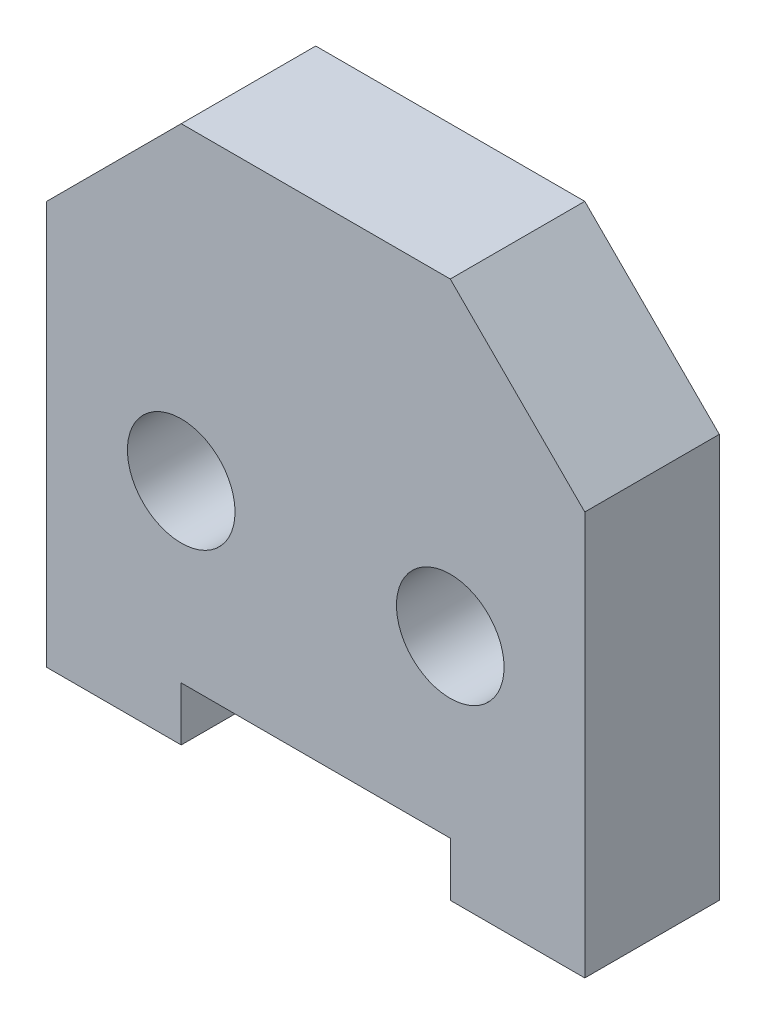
ISO-10303-21;
HEADER;
FILE_DESCRIPTION(('STEP AP214'),'2;1');
FILE_NAME('part.step','',(''),(''),'','','');
FILE_SCHEMA(('AUTOMOTIVE_DESIGN { 1 0 10303 214 1 1 1 1 }'));
ENDSEC;
DATA;
#1=APPLICATION_CONTEXT('core data for automotive mechanical design processes');
#2=APPLICATION_PROTOCOL_DEFINITION('international standard','automotive_design',2000,#1);
#3=PRODUCT_CONTEXT('',#1,'mechanical');
#4=PRODUCT('Part','Part','',(#3));
#5=PRODUCT_RELATED_PRODUCT_CATEGORY('part','',(#4));
#6=PRODUCT_DEFINITION_FORMATION('','',#4);
#7=PRODUCT_DEFINITION_CONTEXT('part definition',#1,'design');
#8=PRODUCT_DEFINITION('design','',#6,#7);
#9=PRODUCT_DEFINITION_SHAPE('','',#8);
#10=(LENGTH_UNIT() NAMED_UNIT(*) SI_UNIT(.MILLI.,.METRE.));
#11=(NAMED_UNIT(*) PLANE_ANGLE_UNIT() SI_UNIT($,.RADIAN.));
#12=(NAMED_UNIT(*) SI_UNIT($,.STERADIAN.) SOLID_ANGLE_UNIT());
#13=UNCERTAINTY_MEASURE_WITH_UNIT(LENGTH_MEASURE(1.E-05),#10,'distance_accuracy_value','');
#14=(GEOMETRIC_REPRESENTATION_CONTEXT(3) GLOBAL_UNCERTAINTY_ASSIGNED_CONTEXT((#13)) GLOBAL_UNIT_ASSIGNED_CONTEXT((#10,
#11,#12)) REPRESENTATION_CONTEXT('',''));
#15=CARTESIAN_POINT('',(0.,0.,0.));
#16=DIRECTION('',(0.,0.,1.));
#17=DIRECTION('',(1.,0.,0.));
#18=AXIS2_PLACEMENT_3D('',#15,#16,#17);
#19=CARTESIAN_POINT('',(0.,0.,10.));
#20=DIRECTION('',(0.,1.,0.));
#21=DIRECTION('',(0.,0.,1.));
#22=AXIS2_PLACEMENT_3D('',#19,#20,#21);
#23=PLANE('',#22);
#24=DIRECTION('',(1.,0.,0.));
#25=VECTOR('',#24,1.);
#26=CARTESIAN_POINT('',(0.,0.,0.));
#27=LINE('',#26,#25);
#28=CARTESIAN_POINT('',(-40.,0.,0.));
#29=VERTEX_POINT('',#28);
#30=CARTESIAN_POINT('',(-30.,0.,0.));
#31=VERTEX_POINT('',#30);
#32=EDGE_CURVE('E129',#29,#31,#27,.T.);
#33=ORIENTED_EDGE('',*,*,#32,.T.);
#34=DIRECTION('',(0.,0.,1.));
#35=VECTOR('',#34,1.);
#36=CARTESIAN_POINT('',(-30.,0.,0.));
#37=LINE('',#36,#35);
#38=CARTESIAN_POINT('',(-30.,0.,10.));
#39=VERTEX_POINT('',#38);
#40=EDGE_CURVE('E112',#31,#39,#37,.T.);
#41=ORIENTED_EDGE('',*,*,#40,.T.);
#42=DIRECTION('',(1.,0.,0.));
#43=VECTOR('',#42,1.);
#44=CARTESIAN_POINT('',(0.,0.,10.));
#45=LINE('',#44,#43);
#46=CARTESIAN_POINT('',(-40.,0.,10.));
#47=VERTEX_POINT('',#46);
#48=EDGE_CURVE('E149',#47,#39,#45,.T.);
#49=ORIENTED_EDGE('',*,*,#48,.F.);
#50=DIRECTION('',(0.,0.,-1.));
#51=VECTOR('',#50,1.);
#52=CARTESIAN_POINT('',(-40.,0.,10.));
#53=LINE('',#52,#51);
#54=EDGE_CURVE('E136',#47,#29,#53,.T.);
#55=ORIENTED_EDGE('',*,*,#54,.T.);
#56=EDGE_LOOP('',(#33,#41,#49,#55));
#57=FACE_BOUND('',#56,.T.);
#58=ADVANCED_FACE('F35',(#57),#23,.F.);
#59=CARTESIAN_POINT('',(0.,40.,10.));
#60=DIRECTION('',(-1.,0.,0.));
#61=DIRECTION('',(0.,0.,1.));
#62=AXIS2_PLACEMENT_3D('',#59,#60,#61);
#63=PLANE('',#62);
#64=DIRECTION('',(0.,1.,0.));
#65=VECTOR('',#64,1.);
#66=CARTESIAN_POINT('',(0.,40.,0.));
#67=LINE('',#66,#65);
#68=CARTESIAN_POINT('',(0.,0.,0.));
#69=VERTEX_POINT('',#68);
#70=CARTESIAN_POINT('',(0.,30.,0.));
#71=VERTEX_POINT('',#70);
#72=EDGE_CURVE('E185',#69,#71,#67,.T.);
#73=ORIENTED_EDGE('',*,*,#72,.T.);
#74=DIRECTION('',(0.,0.,1.));
#75=VECTOR('',#74,1.);
#76=CARTESIAN_POINT('',(0.,30.,10.));
#77=LINE('',#76,#75);
#78=CARTESIAN_POINT('',(0.,30.,10.));
#79=VERTEX_POINT('',#78);
#80=EDGE_CURVE('E11',#71,#79,#77,.T.);
#81=ORIENTED_EDGE('',*,*,#80,.T.);
#82=DIRECTION('',(0.,1.,0.));
#83=VECTOR('',#82,1.);
#84=CARTESIAN_POINT('',(0.,40.,10.));
#85=LINE('',#84,#83);
#86=CARTESIAN_POINT('',(0.,0.,10.));
#87=VERTEX_POINT('',#86);
#88=EDGE_CURVE('E137',#87,#79,#85,.T.);
#89=ORIENTED_EDGE('',*,*,#88,.F.);
#90=DIRECTION('',(0.,0.,-1.));
#91=VECTOR('',#90,1.);
#92=CARTESIAN_POINT('',(0.,0.,10.));
#93=LINE('',#92,#91);
#94=EDGE_CURVE('E146',#87,#69,#93,.T.);
#95=ORIENTED_EDGE('',*,*,#94,.T.);
#96=EDGE_LOOP('',(#73,#81,#89,#95));
#97=FACE_BOUND('',#96,.T.);
#98=ADVANCED_FACE('F237',(#97),#63,.F.);
#99=CARTESIAN_POINT('',(-40.,40.,10.));
#100=DIRECTION('',(0.,-1.,0.));
#101=DIRECTION('',(0.,0.,-1.));
#102=AXIS2_PLACEMENT_3D('',#99,#100,#101);
#103=PLANE('',#102);
#104=DIRECTION('',(-1.,0.,0.));
#105=VECTOR('',#104,1.);
#106=CARTESIAN_POINT('',(-40.,40.,0.));
#107=LINE('',#106,#105);
#108=CARTESIAN_POINT('',(-10.,40.,0.));
#109=VERTEX_POINT('',#108);
#110=CARTESIAN_POINT('',(-30.,40.,0.));
#111=VERTEX_POINT('',#110);
#112=EDGE_CURVE('E181',#109,#111,#107,.T.);
#113=ORIENTED_EDGE('',*,*,#112,.T.);
#114=DIRECTION('',(0.,0.,1.));
#115=VECTOR('',#114,1.);
#116=CARTESIAN_POINT('',(-30.,40.,10.));
#117=LINE('',#116,#115);
#118=CARTESIAN_POINT('',(-30.,40.,10.));
#119=VERTEX_POINT('',#118);
#120=EDGE_CURVE('E161',#111,#119,#117,.T.);
#121=ORIENTED_EDGE('',*,*,#120,.T.);
#122=DIRECTION('',(-1.,0.,0.));
#123=VECTOR('',#122,1.);
#124=CARTESIAN_POINT('',(-40.,40.,10.));
#125=LINE('',#124,#123);
#126=CARTESIAN_POINT('',(-10.,40.,10.));
#127=VERTEX_POINT('',#126);
#128=EDGE_CURVE('E140',#127,#119,#125,.T.);
#129=ORIENTED_EDGE('',*,*,#128,.F.);
#130=DIRECTION('',(0.,0.,-1.));
#131=VECTOR('',#130,1.);
#132=CARTESIAN_POINT('',(-10.,40.,10.));
#133=LINE('',#132,#131);
#134=EDGE_CURVE('E158',#127,#109,#133,.T.);
#135=ORIENTED_EDGE('',*,*,#134,.T.);
#136=EDGE_LOOP('',(#113,#121,#129,#135));
#137=FACE_BOUND('',#136,.T.);
#138=ADVANCED_FACE('F183',(#137),#103,.F.);
#139=CARTESIAN_POINT('',(-40.,0.,10.));
#140=DIRECTION('',(1.,0.,0.));
#141=DIRECTION('',(0.,0.,-1.));
#142=AXIS2_PLACEMENT_3D('',#139,#140,#141);
#143=PLANE('',#142);
#144=DIRECTION('',(0.,-1.,0.));
#145=VECTOR('',#144,1.);
#146=CARTESIAN_POINT('',(-40.,0.,10.));
#147=LINE('',#146,#145);
#148=CARTESIAN_POINT('',(-40.,30.,10.));
#149=VERTEX_POINT('',#148);
#150=EDGE_CURVE('E169',#149,#47,#147,.T.);
#151=ORIENTED_EDGE('',*,*,#150,.F.);
#152=DIRECTION('',(0.,0.,-1.));
#153=VECTOR('',#152,1.);
#154=CARTESIAN_POINT('',(-40.,30.,10.));
#155=LINE('',#154,#153);
#156=CARTESIAN_POINT('',(-40.,30.,0.));
#157=VERTEX_POINT('',#156);
#158=EDGE_CURVE('E151',#149,#157,#155,.T.);
#159=ORIENTED_EDGE('',*,*,#158,.T.);
#160=DIRECTION('',(0.,-1.,0.));
#161=VECTOR('',#160,1.);
#162=CARTESIAN_POINT('',(-40.,0.,0.));
#163=LINE('',#162,#161);
#164=EDGE_CURVE('E142',#157,#29,#163,.T.);
#165=ORIENTED_EDGE('',*,*,#164,.T.);
#166=ORIENTED_EDGE('',*,*,#54,.F.);
#167=EDGE_LOOP('',(#151,#159,#165,#166));
#168=FACE_BOUND('',#167,.T.);
#169=ADVANCED_FACE('F175',(#168),#143,.F.);
#170=CARTESIAN_POINT('',(-10.,0.,10.));
#171=VERTEX_POINT('',#170);
#172=EDGE_CURVE('E176',#171,#87,#45,.T.);
#173=ORIENTED_EDGE('',*,*,#172,.F.);
#174=DIRECTION('',(0.,0.,1.));
#175=VECTOR('',#174,1.);
#176=CARTESIAN_POINT('',(-10.,0.,0.));
#177=LINE('',#176,#175);
#178=CARTESIAN_POINT('',(-10.,0.,0.));
#179=VERTEX_POINT('',#178);
#180=EDGE_CURVE('E122',#179,#171,#177,.T.);
#181=ORIENTED_EDGE('',*,*,#180,.F.);
#182=EDGE_CURVE('E138',#179,#69,#27,.T.);
#183=ORIENTED_EDGE('',*,*,#182,.T.);
#184=ORIENTED_EDGE('',*,*,#94,.F.);
#185=EDGE_LOOP('',(#173,#181,#183,#184));
#186=FACE_BOUND('',#185,.T.);
#187=ADVANCED_FACE('F222',(#186),#23,.F.);
#188=CARTESIAN_POINT('',(0.,0.,10.));
#189=DIRECTION('',(0.,0.,-1.));
#190=DIRECTION('',(-1.,0.,0.));
#191=AXIS2_PLACEMENT_3D('',#188,#189,#190);
#192=PLANE('',#191);
#193=CARTESIAN_POINT('',(-10.,17.,10.));
#194=DIRECTION('',(0.,0.,1.));
#195=DIRECTION('',(1.,0.,0.));
#196=AXIS2_PLACEMENT_3D('',#193,#194,#195);
#197=CIRCLE('',#196,4.);
#198=CARTESIAN_POINT('',(-6.,17.,10.));
#199=VERTEX_POINT('',#198);
#200=EDGE_CURVE('E197',#199,#199,#197,.T.);
#201=ORIENTED_EDGE('',*,*,#200,.F.);
#202=EDGE_LOOP('',(#201));
#203=FACE_BOUND('',#202,.T.);
#204=CARTESIAN_POINT('',(-30.,17.,10.));
#205=DIRECTION('',(0.,0.,1.));
#206=DIRECTION('',(1.,0.,0.));
#207=AXIS2_PLACEMENT_3D('',#204,#205,#206);
#208=CIRCLE('',#207,4.);
#209=CARTESIAN_POINT('',(-26.,17.,10.));
#210=VERTEX_POINT('',#209);
#211=EDGE_CURVE('E191',#210,#210,#208,.T.);
#212=ORIENTED_EDGE('',*,*,#211,.F.);
#213=EDGE_LOOP('',(#212));
#214=FACE_BOUND('',#213,.T.);
#215=ORIENTED_EDGE('',*,*,#48,.T.);
#216=DIRECTION('',(0.,-1.,0.));
#217=VECTOR('',#216,1.);
#218=CARTESIAN_POINT('',(-30.,0.,10.));
#219=LINE('',#218,#217);
#220=CARTESIAN_POINT('',(-30.,4.,10.));
#221=VERTEX_POINT('',#220);
#222=EDGE_CURVE('E117',#221,#39,#219,.T.);
#223=ORIENTED_EDGE('',*,*,#222,.F.);
#224=DIRECTION('',(-1.,0.,0.));
#225=VECTOR('',#224,1.);
#226=CARTESIAN_POINT('',(-30.,4.,10.));
#227=LINE('',#226,#225);
#228=CARTESIAN_POINT('',(-10.,4.,10.));
#229=VERTEX_POINT('',#228);
#230=EDGE_CURVE('E132',#229,#221,#227,.T.);
#231=ORIENTED_EDGE('',*,*,#230,.F.);
#232=DIRECTION('',(0.,1.,0.));
#233=VECTOR('',#232,1.);
#234=CARTESIAN_POINT('',(-10.,0.,10.));
#235=LINE('',#234,#233);
#236=EDGE_CURVE('E209',#171,#229,#235,.T.);
#237=ORIENTED_EDGE('',*,*,#236,.F.);
#238=ORIENTED_EDGE('',*,*,#172,.T.);
#239=ORIENTED_EDGE('',*,*,#88,.T.);
#240=DIRECTION('',(0.707106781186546,-0.707106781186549,0.));
#241=VECTOR('',#240,1.);
#242=CARTESIAN_POINT('',(-10.,40.,10.));
#243=LINE('',#242,#241);
#244=EDGE_CURVE('E163',#79,#127,#243,.F.);
#245=ORIENTED_EDGE('',*,*,#244,.T.);
#246=ORIENTED_EDGE('',*,*,#128,.T.);
#247=DIRECTION('',(0.707106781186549,0.707106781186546,0.));
#248=VECTOR('',#247,1.);
#249=CARTESIAN_POINT('',(-40.,30.,10.));
#250=LINE('',#249,#248);
#251=EDGE_CURVE('E43',#119,#149,#250,.F.);
#252=ORIENTED_EDGE('',*,*,#251,.T.);
#253=ORIENTED_EDGE('',*,*,#150,.T.);
#254=EDGE_LOOP('',(#215,#223,#231,#237,#238,#239,#245,#246,#252,#253));
#255=FACE_BOUND('',#254,.T.);
#256=ADVANCED_FACE('F168',(#203,#214,#255),#192,.F.);
#257=CARTESIAN_POINT('',(0.,0.,0.));
#258=DIRECTION('',(0.,0.,-1.));
#259=DIRECTION('',(-1.,0.,0.));
#260=AXIS2_PLACEMENT_3D('',#257,#258,#259);
#261=PLANE('',#260);
#262=DIRECTION('',(0.,-1.,0.));
#263=VECTOR('',#262,1.);
#264=CARTESIAN_POINT('',(-30.,0.,0.));
#265=LINE('',#264,#263);
#266=CARTESIAN_POINT('',(-30.,4.,0.));
#267=VERTEX_POINT('',#266);
#268=EDGE_CURVE('E115',#267,#31,#265,.T.);
#269=ORIENTED_EDGE('',*,*,#268,.T.);
#270=ORIENTED_EDGE('',*,*,#32,.F.);
#271=ORIENTED_EDGE('',*,*,#164,.F.);
#272=DIRECTION('',(-0.707106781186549,-0.707106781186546,0.));
#273=VECTOR('',#272,1.);
#274=CARTESIAN_POINT('',(-34.9999999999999,35.,0.));
#275=LINE('',#274,#273);
#276=EDGE_CURVE('E156',#157,#111,#275,.F.);
#277=ORIENTED_EDGE('',*,*,#276,.T.);
#278=ORIENTED_EDGE('',*,*,#112,.F.);
#279=DIRECTION('',(-0.707106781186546,0.707106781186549,0.));
#280=VECTOR('',#279,1.);
#281=CARTESIAN_POINT('',(15.,14.9999999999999,0.));
#282=LINE('',#281,#280);
#283=EDGE_CURVE('E154',#109,#71,#282,.F.);
#284=ORIENTED_EDGE('',*,*,#283,.T.);
#285=ORIENTED_EDGE('',*,*,#72,.F.);
#286=ORIENTED_EDGE('',*,*,#182,.F.);
#287=DIRECTION('',(0.,1.,0.));
#288=VECTOR('',#287,1.);
#289=CARTESIAN_POINT('',(-10.,0.,0.));
#290=LINE('',#289,#288);
#291=CARTESIAN_POINT('',(-10.,4.,0.));
#292=VERTEX_POINT('',#291);
#293=EDGE_CURVE('E131',#179,#292,#290,.T.);
#294=ORIENTED_EDGE('',*,*,#293,.T.);
#295=DIRECTION('',(-1.,0.,0.));
#296=VECTOR('',#295,1.);
#297=CARTESIAN_POINT('',(-30.,4.,0.));
#298=LINE('',#297,#296);
#299=EDGE_CURVE('E50',#292,#267,#298,.T.);
#300=ORIENTED_EDGE('',*,*,#299,.T.);
#301=EDGE_LOOP('',(#269,#270,#271,#277,#278,#284,#285,#286,#294,#300));
#302=FACE_BOUND('',#301,.T.);
#303=CARTESIAN_POINT('',(-10.,17.,0.));
#304=DIRECTION('',(0.,0.,1.));
#305=DIRECTION('',(1.,0.,0.));
#306=AXIS2_PLACEMENT_3D('',#303,#304,#305);
#307=CIRCLE('',#306,4.);
#308=CARTESIAN_POINT('',(-6.,17.,0.));
#309=VERTEX_POINT('',#308);
#310=EDGE_CURVE('E194',#309,#309,#307,.T.);
#311=ORIENTED_EDGE('',*,*,#310,.T.);
#312=EDGE_LOOP('',(#311));
#313=FACE_BOUND('',#312,.T.);
#314=CARTESIAN_POINT('',(-30.,17.,0.));
#315=DIRECTION('',(0.,0.,1.));
#316=DIRECTION('',(1.,0.,0.));
#317=AXIS2_PLACEMENT_3D('',#314,#315,#316);
#318=CIRCLE('',#317,4.);
#319=CARTESIAN_POINT('',(-26.,17.,0.));
#320=VERTEX_POINT('',#319);
#321=EDGE_CURVE('E186',#320,#320,#318,.T.);
#322=ORIENTED_EDGE('',*,*,#321,.T.);
#323=EDGE_LOOP('',(#322));
#324=FACE_BOUND('',#323,.T.);
#325=ADVANCED_FACE('F126',(#302,#313,#324),#261,.T.);
#326=CARTESIAN_POINT('',(-40.,30.,10.));
#327=DIRECTION('',(0.707106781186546,-0.707106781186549,0.));
#328=DIRECTION('',(0.,0.,-1.));
#329=AXIS2_PLACEMENT_3D('',#326,#327,#328);
#330=PLANE('',#329);
#331=ORIENTED_EDGE('',*,*,#251,.F.);
#332=ORIENTED_EDGE('',*,*,#120,.F.);
#333=ORIENTED_EDGE('',*,*,#276,.F.);
#334=ORIENTED_EDGE('',*,*,#158,.F.);
#335=EDGE_LOOP('',(#331,#332,#333,#334));
#336=FACE_BOUND('',#335,.T.);
#337=ADVANCED_FACE('F178',(#336),#330,.F.);
#338=CARTESIAN_POINT('',(-10.,40.,10.));
#339=DIRECTION('',(-0.707106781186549,-0.707106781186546,0.));
#340=DIRECTION('',(0.,0.,-1.));
#341=AXIS2_PLACEMENT_3D('',#338,#339,#340);
#342=PLANE('',#341);
#343=ORIENTED_EDGE('',*,*,#244,.F.);
#344=ORIENTED_EDGE('',*,*,#80,.F.);
#345=ORIENTED_EDGE('',*,*,#283,.F.);
#346=ORIENTED_EDGE('',*,*,#134,.F.);
#347=EDGE_LOOP('',(#343,#344,#345,#346));
#348=FACE_BOUND('',#347,.T.);
#349=ADVANCED_FACE('F37',(#348),#342,.F.);
#350=CARTESIAN_POINT('',(-30.,17.,0.));
#351=DIRECTION('',(0.,0.,1.));
#352=DIRECTION('',(1.,0.,0.));
#353=AXIS2_PLACEMENT_3D('',#350,#351,#352);
#354=CYLINDRICAL_SURFACE('',#353,4.);
#355=ORIENTED_EDGE('',*,*,#321,.F.);
#356=EDGE_LOOP('',(#355));
#357=FACE_BOUND('',#356,.T.);
#358=ORIENTED_EDGE('',*,*,#211,.T.);
#359=EDGE_LOOP('',(#358));
#360=FACE_BOUND('',#359,.T.);
#361=ADVANCED_FACE('F261',(#357,#360),#354,.F.);
#362=CARTESIAN_POINT('',(-10.,17.,0.));
#363=DIRECTION('',(0.,0.,1.));
#364=DIRECTION('',(1.,0.,0.));
#365=AXIS2_PLACEMENT_3D('',#362,#363,#364);
#366=CYLINDRICAL_SURFACE('',#365,4.);
#367=ORIENTED_EDGE('',*,*,#310,.F.);
#368=EDGE_LOOP('',(#367));
#369=FACE_BOUND('',#368,.T.);
#370=ORIENTED_EDGE('',*,*,#200,.T.);
#371=EDGE_LOOP('',(#370));
#372=FACE_BOUND('',#371,.T.);
#373=ADVANCED_FACE('F234',(#369,#372),#366,.F.);
#374=CARTESIAN_POINT('',(-30.,0.,0.));
#375=DIRECTION('',(-1.,0.,0.));
#376=DIRECTION('',(0.,0.,1.));
#377=AXIS2_PLACEMENT_3D('',#374,#375,#376);
#378=PLANE('',#377);
#379=ORIENTED_EDGE('',*,*,#222,.T.);
#380=ORIENTED_EDGE('',*,*,#40,.F.);
#381=ORIENTED_EDGE('',*,*,#268,.F.);
#382=DIRECTION('',(0.,0.,1.));
#383=VECTOR('',#382,1.);
#384=CARTESIAN_POINT('',(-30.,4.,0.));
#385=LINE('',#384,#383);
#386=EDGE_CURVE('E200',#267,#221,#385,.T.);
#387=ORIENTED_EDGE('',*,*,#386,.T.);
#388=EDGE_LOOP('',(#379,#380,#381,#387));
#389=FACE_BOUND('',#388,.T.);
#390=ADVANCED_FACE('F114',(#389),#378,.F.);
#391=CARTESIAN_POINT('',(-30.,4.,0.));
#392=DIRECTION('',(0.,1.,0.));
#393=DIRECTION('',(0.,0.,1.));
#394=AXIS2_PLACEMENT_3D('',#391,#392,#393);
#395=PLANE('',#394);
#396=ORIENTED_EDGE('',*,*,#230,.T.);
#397=ORIENTED_EDGE('',*,*,#386,.F.);
#398=ORIENTED_EDGE('',*,*,#299,.F.);
#399=DIRECTION('',(0.,0.,1.));
#400=VECTOR('',#399,1.);
#401=CARTESIAN_POINT('',(-10.,4.,0.));
#402=LINE('',#401,#400);
#403=EDGE_CURVE('E204',#292,#229,#402,.T.);
#404=ORIENTED_EDGE('',*,*,#403,.T.);
#405=EDGE_LOOP('',(#396,#397,#398,#404));
#406=FACE_BOUND('',#405,.T.);
#407=ADVANCED_FACE('F226',(#406),#395,.F.);
#408=CARTESIAN_POINT('',(-10.,0.,0.));
#409=DIRECTION('',(1.,0.,0.));
#410=DIRECTION('',(0.,1.,0.));
#411=AXIS2_PLACEMENT_3D('',#408,#409,#410);
#412=PLANE('',#411);
#413=ORIENTED_EDGE('',*,*,#236,.T.);
#414=ORIENTED_EDGE('',*,*,#403,.F.);
#415=ORIENTED_EDGE('',*,*,#293,.F.);
#416=ORIENTED_EDGE('',*,*,#180,.T.);
#417=EDGE_LOOP('',(#413,#414,#415,#416));
#418=FACE_BOUND('',#417,.T.);
#419=ADVANCED_FACE('F218',(#418),#412,.F.);
#420=CLOSED_SHELL('',(#58,#98,#138,#169,#187,#256,#325,#337,#349,#361,#373,#390,#407,#419));
#421=MANIFOLD_SOLID_BREP('B2',#420);
#422=ADVANCED_BREP_SHAPE_REPRESENTATION('',(#18,#421),#14);
#423=SHAPE_DEFINITION_REPRESENTATION(#9,#422);
ENDSEC;
END-ISO-10303-21;
